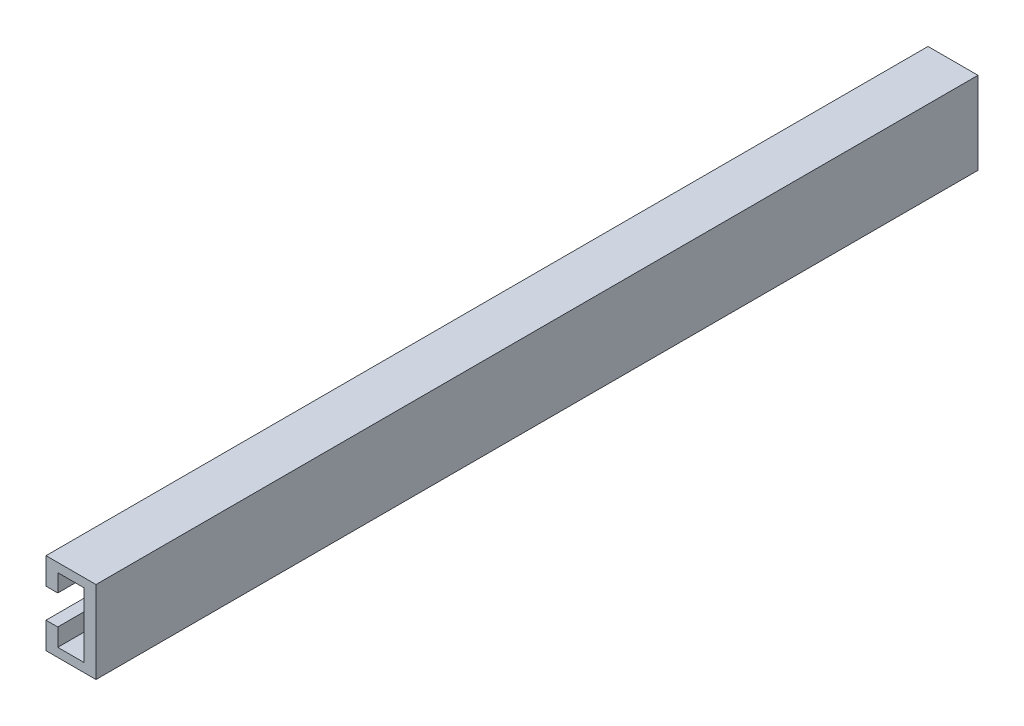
from build123d import *

# Parameters (mm, degrees)
SALIENTE_EXTRUIR1_DEPTH = 150


with BuildPart() as part:
    # Croquis1 → Saliente-Extruir1 (new, symmetric)
    with BuildSketch(Plane.XY):
        Polygon((-8.5, -5), (-8.5, -14), (8.5, -14), (8.5, 14), (-8.5, 14), (-8.5, 5), (-4.5, 5), (-4.5, 11), (4.5, 11), (4.5, -11), (-4.5, -11), (-4.5, -5), align=None)
    extrude(amount=SALIENTE_EXTRUIR1_DEPTH, both=True)


solid = part.part
